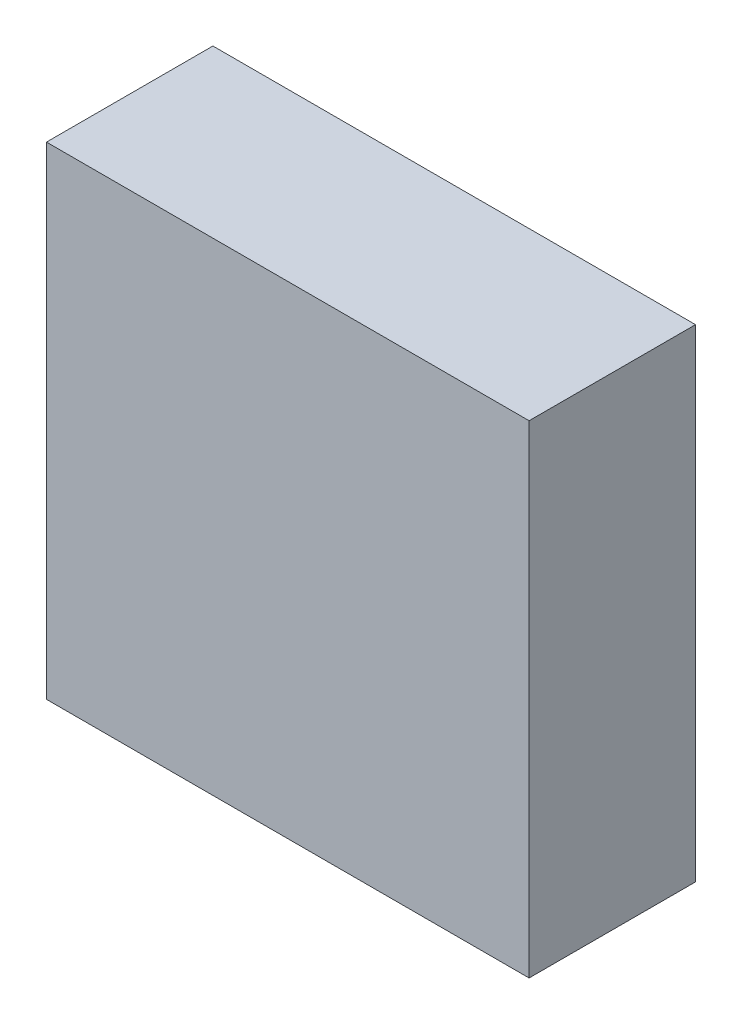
from build123d import *

# Parameters (mm, degrees)
SKETCH1_W      = 29
SKETCH1_H      = 29
EXTRUDE1_DEPTH = 10


with BuildPart() as part:
    # Sketch1 → Extrude1 (new body)
    with BuildSketch(Plane.XY):
        Rectangle(SKETCH1_W, SKETCH1_H)
    extrude(amount=EXTRUDE1_DEPTH)


solid = part.part
